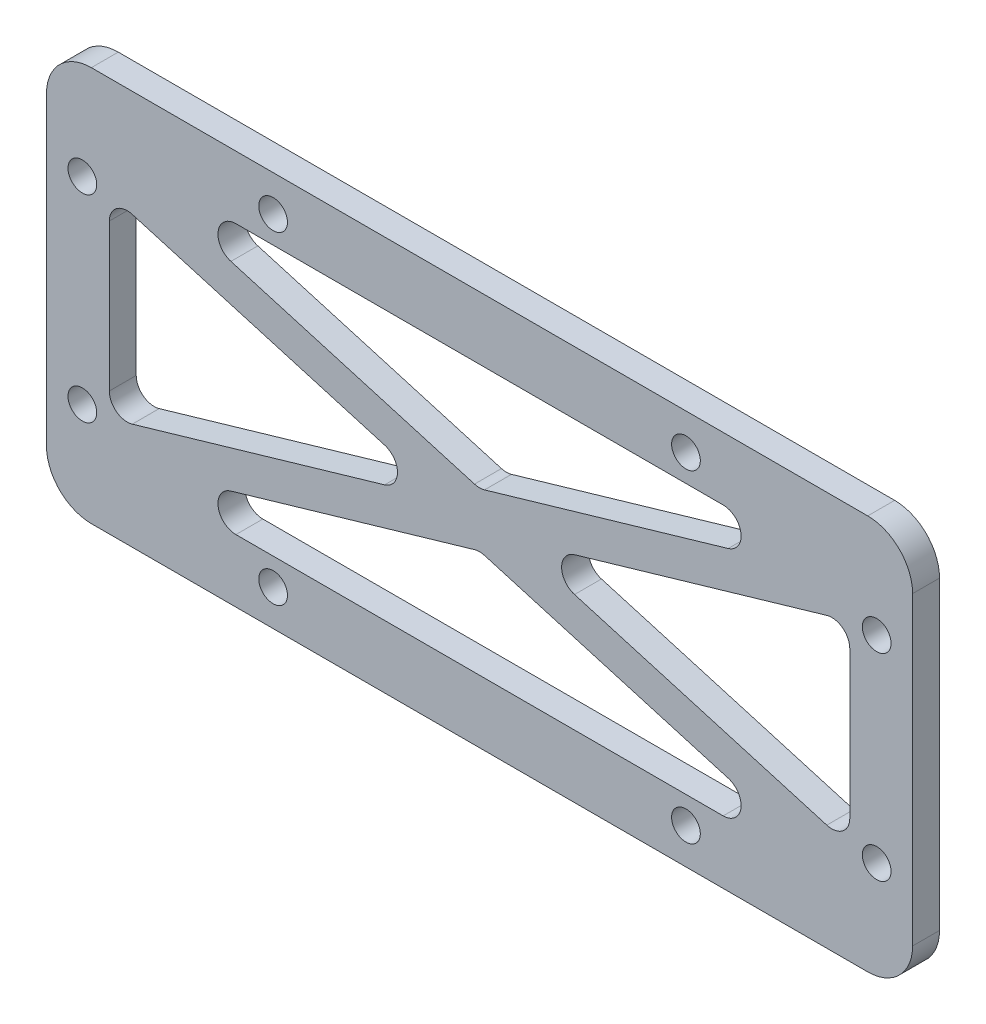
ISO-10303-21;
HEADER;
FILE_DESCRIPTION(('STEP AP214'),'2;1');
FILE_NAME('part.step','',(''),(''),'','','');
FILE_SCHEMA(('AUTOMOTIVE_DESIGN { 1 0 10303 214 1 1 1 1 }'));
ENDSEC;
DATA;
#1=APPLICATION_CONTEXT('core data for automotive mechanical design processes');
#2=APPLICATION_PROTOCOL_DEFINITION('international standard','automotive_design',2000,#1);
#3=PRODUCT_CONTEXT('',#1,'mechanical');
#4=PRODUCT('Part','Part','',(#3));
#5=PRODUCT_RELATED_PRODUCT_CATEGORY('part','',(#4));
#6=PRODUCT_DEFINITION_FORMATION('','',#4);
#7=PRODUCT_DEFINITION_CONTEXT('part definition',#1,'design');
#8=PRODUCT_DEFINITION('design','',#6,#7);
#9=PRODUCT_DEFINITION_SHAPE('','',#8);
#10=(LENGTH_UNIT() NAMED_UNIT(*) SI_UNIT(.MILLI.,.METRE.));
#11=(NAMED_UNIT(*) PLANE_ANGLE_UNIT() SI_UNIT($,.RADIAN.));
#12=(NAMED_UNIT(*) SI_UNIT($,.STERADIAN.) SOLID_ANGLE_UNIT());
#13=UNCERTAINTY_MEASURE_WITH_UNIT(LENGTH_MEASURE(1.E-05),#10,'distance_accuracy_value','');
#14=(GEOMETRIC_REPRESENTATION_CONTEXT(3) GLOBAL_UNCERTAINTY_ASSIGNED_CONTEXT((#13)) GLOBAL_UNIT_ASSIGNED_CONTEXT((#10,
#11,#12)) REPRESENTATION_CONTEXT('',''));
#15=CARTESIAN_POINT('',(0.,0.,0.));
#16=DIRECTION('',(0.,0.,1.));
#17=DIRECTION('',(1.,0.,0.));
#18=AXIS2_PLACEMENT_3D('',#15,#16,#17);
#19=CARTESIAN_POINT('',(-48.2507771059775,-22.,3.));
#20=DIRECTION('',(0.,1.,0.));
#21=DIRECTION('',(0.,0.,1.));
#22=AXIS2_PLACEMENT_3D('',#19,#20,#21);
#23=PLANE('',#22);
#24=DIRECTION('',(1.,0.,0.));
#25=VECTOR('',#24,1.);
#26=CARTESIAN_POINT('',(-48.2507771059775,-22.,3.));
#27=LINE('',#26,#25);
#28=CARTESIAN_POINT('',(-43.2507771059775,-22.,3.));
#29=VERTEX_POINT('',#28);
#30=CARTESIAN_POINT('',(43.2507771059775,-22.,3.));
#31=VERTEX_POINT('',#30);
#32=EDGE_CURVE('E267',#29,#31,#27,.T.);
#33=ORIENTED_EDGE('',*,*,#32,.F.);
#34=DIRECTION('',(0.,0.,-1.));
#35=VECTOR('',#34,1.);
#36=CARTESIAN_POINT('',(-43.2507771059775,-22.,0.));
#37=LINE('',#36,#35);
#38=CARTESIAN_POINT('',(-43.2507771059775,-22.,0.));
#39=VERTEX_POINT('',#38);
#40=EDGE_CURVE('E298',#29,#39,#37,.T.);
#41=ORIENTED_EDGE('',*,*,#40,.T.);
#42=DIRECTION('',(1.,0.,0.));
#43=VECTOR('',#42,1.);
#44=CARTESIAN_POINT('',(-48.2507771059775,-22.,0.));
#45=LINE('',#44,#43);
#46=CARTESIAN_POINT('',(43.2507771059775,-22.,0.));
#47=VERTEX_POINT('',#46);
#48=EDGE_CURVE('E251',#39,#47,#45,.T.);
#49=ORIENTED_EDGE('',*,*,#48,.T.);
#50=DIRECTION('',(0.,0.,-1.));
#51=VECTOR('',#50,1.);
#52=CARTESIAN_POINT('',(43.2507771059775,-22.,3.));
#53=LINE('',#52,#51);
#54=EDGE_CURVE('E296',#47,#31,#53,.F.);
#55=ORIENTED_EDGE('',*,*,#54,.T.);
#56=EDGE_LOOP('',(#33,#41,#49,#55));
#57=FACE_BOUND('',#56,.T.);
#58=ADVANCED_FACE('F36',(#57),#23,.F.);
#59=CARTESIAN_POINT('',(48.2507771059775,-22.,3.));
#60=DIRECTION('',(-1.,0.,0.));
#61=DIRECTION('',(0.,0.,1.));
#62=AXIS2_PLACEMENT_3D('',#59,#60,#61);
#63=PLANE('',#62);
#64=DIRECTION('',(0.,1.,0.));
#65=VECTOR('',#64,1.);
#66=CARTESIAN_POINT('',(48.2507771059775,-22.,3.));
#67=LINE('',#66,#65);
#68=CARTESIAN_POINT('',(48.2507771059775,-17.,3.));
#69=VERTEX_POINT('',#68);
#70=CARTESIAN_POINT('',(48.2507771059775,17.,3.));
#71=VERTEX_POINT('',#70);
#72=EDGE_CURVE('E508',#69,#71,#67,.T.);
#73=ORIENTED_EDGE('',*,*,#72,.F.);
#74=DIRECTION('',(0.,0.,-1.));
#75=VECTOR('',#74,1.);
#76=CARTESIAN_POINT('',(48.2507771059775,-17.,3.));
#77=LINE('',#76,#75);
#78=CARTESIAN_POINT('',(48.2507771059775,-17.,0.));
#79=VERTEX_POINT('',#78);
#80=EDGE_CURVE('E302',#69,#79,#77,.T.);
#81=ORIENTED_EDGE('',*,*,#80,.T.);
#82=DIRECTION('',(0.,1.,0.));
#83=VECTOR('',#82,1.);
#84=CARTESIAN_POINT('',(48.2507771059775,-22.,0.));
#85=LINE('',#84,#83);
#86=CARTESIAN_POINT('',(48.2507771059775,17.,0.));
#87=VERTEX_POINT('',#86);
#88=EDGE_CURVE('E514',#79,#87,#85,.T.);
#89=ORIENTED_EDGE('',*,*,#88,.T.);
#90=DIRECTION('',(0.,0.,-1.));
#91=VECTOR('',#90,1.);
#92=CARTESIAN_POINT('',(48.2507771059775,17.,3.));
#93=LINE('',#92,#91);
#94=EDGE_CURVE('E300',#87,#71,#93,.F.);
#95=ORIENTED_EDGE('',*,*,#94,.T.);
#96=EDGE_LOOP('',(#73,#81,#89,#95));
#97=FACE_BOUND('',#96,.T.);
#98=ADVANCED_FACE('F534',(#97),#63,.F.);
#99=CARTESIAN_POINT('',(-48.2507771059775,22.,3.));
#100=DIRECTION('',(0.,1.,0.));
#101=DIRECTION('',(0.,0.,1.));
#102=AXIS2_PLACEMENT_3D('',#99,#100,#101);
#103=PLANE('',#102);
#104=DIRECTION('',(1.,0.,0.));
#105=VECTOR('',#104,1.);
#106=CARTESIAN_POINT('',(-48.2507771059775,22.,0.));
#107=LINE('',#106,#105);
#108=CARTESIAN_POINT('',(-43.2507771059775,22.,0.));
#109=VERTEX_POINT('',#108);
#110=CARTESIAN_POINT('',(43.2507771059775,22.,0.));
#111=VERTEX_POINT('',#110);
#112=EDGE_CURVE('E268',#109,#111,#107,.T.);
#113=ORIENTED_EDGE('',*,*,#112,.F.);
#114=DIRECTION('',(0.,0.,-1.));
#115=VECTOR('',#114,1.);
#116=CARTESIAN_POINT('',(-43.2507771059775,22.,3.));
#117=LINE('',#116,#115);
#118=CARTESIAN_POINT('',(-43.2507771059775,22.,3.));
#119=VERTEX_POINT('',#118);
#120=EDGE_CURVE('E287',#109,#119,#117,.F.);
#121=ORIENTED_EDGE('',*,*,#120,.T.);
#122=DIRECTION('',(1.,0.,0.));
#123=VECTOR('',#122,1.);
#124=CARTESIAN_POINT('',(-48.2507771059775,22.,3.));
#125=LINE('',#124,#123);
#126=CARTESIAN_POINT('',(43.2507771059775,22.,3.));
#127=VERTEX_POINT('',#126);
#128=EDGE_CURVE('E277',#119,#127,#125,.T.);
#129=ORIENTED_EDGE('',*,*,#128,.T.);
#130=DIRECTION('',(0.,0.,-1.));
#131=VECTOR('',#130,1.);
#132=CARTESIAN_POINT('',(43.2507771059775,22.,0.));
#133=LINE('',#132,#131);
#134=EDGE_CURVE('E284',#127,#111,#133,.T.);
#135=ORIENTED_EDGE('',*,*,#134,.T.);
#136=EDGE_LOOP('',(#113,#121,#129,#135));
#137=FACE_BOUND('',#136,.T.);
#138=ADVANCED_FACE('F521',(#137),#103,.T.);
#139=CARTESIAN_POINT('',(-48.2507771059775,-22.,3.));
#140=DIRECTION('',(-1.,0.,0.));
#141=DIRECTION('',(0.,0.,1.));
#142=AXIS2_PLACEMENT_3D('',#139,#140,#141);
#143=PLANE('',#142);
#144=DIRECTION('',(0.,1.,0.));
#145=VECTOR('',#144,1.);
#146=CARTESIAN_POINT('',(-48.2507771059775,-22.,3.));
#147=LINE('',#146,#145);
#148=CARTESIAN_POINT('',(-48.2507771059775,-17.,3.));
#149=VERTEX_POINT('',#148);
#150=CARTESIAN_POINT('',(-48.2507771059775,17.,3.));
#151=VERTEX_POINT('',#150);
#152=EDGE_CURVE('E273',#149,#151,#147,.T.);
#153=ORIENTED_EDGE('',*,*,#152,.T.);
#154=DIRECTION('',(0.,0.,-1.));
#155=VECTOR('',#154,1.);
#156=CARTESIAN_POINT('',(-48.2507771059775,17.,3.));
#157=LINE('',#156,#155);
#158=CARTESIAN_POINT('',(-48.2507771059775,17.,0.));
#159=VERTEX_POINT('',#158);
#160=EDGE_CURVE('E266',#151,#159,#157,.T.);
#161=ORIENTED_EDGE('',*,*,#160,.T.);
#162=DIRECTION('',(0.,1.,0.));
#163=VECTOR('',#162,1.);
#164=CARTESIAN_POINT('',(-48.2507771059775,-22.,0.));
#165=LINE('',#164,#163);
#166=CARTESIAN_POINT('',(-48.2507771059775,-17.,0.));
#167=VERTEX_POINT('',#166);
#168=EDGE_CURVE('E249',#167,#159,#165,.T.);
#169=ORIENTED_EDGE('',*,*,#168,.F.);
#170=DIRECTION('',(0.,0.,-1.));
#171=VECTOR('',#170,1.);
#172=CARTESIAN_POINT('',(-48.2507771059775,-17.,3.));
#173=LINE('',#172,#171);
#174=EDGE_CURVE('E263',#167,#149,#173,.F.);
#175=ORIENTED_EDGE('',*,*,#174,.T.);
#176=EDGE_LOOP('',(#153,#161,#169,#175));
#177=FACE_BOUND('',#176,.T.);
#178=ADVANCED_FACE('F262',(#177),#143,.T.);
#179=CARTESIAN_POINT('',(0.,0.,3.));
#180=DIRECTION('',(0.,0.,1.));
#181=DIRECTION('',(1.,0.,0.));
#182=AXIS2_PLACEMENT_3D('',#179,#180,#181);
#183=PLANE('',#182);
#184=DIRECTION('',(-0.96,-0.28,0.));
#185=VECTOR('',#184,1.);
#186=CARTESIAN_POINT('',(-41.1428571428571,-15.,3.));
#187=LINE('',#186,#185);
#188=CARTESIAN_POINT('',(-0.559999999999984,-3.16333333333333,3.));
#189=VERTEX_POINT('',#188);
#190=CARTESIAN_POINT('',(-27.7028571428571,-11.08,3.));
#191=VERTEX_POINT('',#190);
#192=EDGE_CURVE('E1006',#189,#191,#187,.T.);
#193=ORIENTED_EDGE('',*,*,#192,.F.);
#194=CARTESIAN_POINT('',(0.,-5.08333333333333,3.));
#195=DIRECTION('',(0.,0.,1.));
#196=DIRECTION('',(1.,0.,0.));
#197=AXIS2_PLACEMENT_3D('',#194,#195,#196);
#198=CIRCLE('',#197,2.);
#199=CARTESIAN_POINT('',(0.560000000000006,-3.16333333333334,3.));
#200=VERTEX_POINT('',#199);
#201=EDGE_CURVE('E380',#189,#200,#198,.F.);
#202=ORIENTED_EDGE('',*,*,#201,.T.);
#203=DIRECTION('',(-0.96,0.28,0.));
#204=VECTOR('',#203,1.);
#205=CARTESIAN_POINT('',(0.,-3.,3.));
#206=LINE('',#205,#204);
#207=CARTESIAN_POINT('',(27.7028571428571,-11.08,3.));
#208=VERTEX_POINT('',#207);
#209=EDGE_CURVE('E1013',#208,#200,#206,.T.);
#210=ORIENTED_EDGE('',*,*,#209,.F.);
#211=CARTESIAN_POINT('',(27.1428571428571,-13.,3.));
#212=DIRECTION('',(0.,0.,1.));
#213=DIRECTION('',(1.,0.,0.));
#214=AXIS2_PLACEMENT_3D('',#211,#212,#213);
#215=CIRCLE('',#214,2.);
#216=CARTESIAN_POINT('',(27.1428571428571,-15.,3.));
#217=VERTEX_POINT('',#216);
#218=EDGE_CURVE('E372',#208,#217,#215,.F.);
#219=ORIENTED_EDGE('',*,*,#218,.T.);
#220=DIRECTION('',(1.,0.,0.));
#221=VECTOR('',#220,1.);
#222=CARTESIAN_POINT('',(41.1428571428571,-15.,3.));
#223=LINE('',#222,#221);
#224=CARTESIAN_POINT('',(-27.1428571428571,-15.,3.));
#225=VERTEX_POINT('',#224);
#226=EDGE_CURVE('E1007',#225,#217,#223,.T.);
#227=ORIENTED_EDGE('',*,*,#226,.F.);
#228=CARTESIAN_POINT('',(-27.1428571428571,-13.,3.));
#229=DIRECTION('',(0.,0.,1.));
#230=DIRECTION('',(1.,0.,0.));
#231=AXIS2_PLACEMENT_3D('',#228,#229,#230);
#232=CIRCLE('',#231,2.);
#233=EDGE_CURVE('E368',#225,#191,#232,.F.);
#234=ORIENTED_EDGE('',*,*,#233,.T.);
#235=EDGE_LOOP('',(#193,#202,#210,#219,#227,#234));
#236=FACE_BOUND('',#235,.T.);
#237=DIRECTION('',(0.,1.,0.));
#238=VECTOR('',#237,1.);
#239=CARTESIAN_POINT('',(41.2507771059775,10.8648099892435,3.));
#240=LINE('',#239,#238);
#241=CARTESIAN_POINT('',(41.2507771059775,-8.19814332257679,3.));
#242=VERTEX_POINT('',#241);
#243=CARTESIAN_POINT('',(41.2507771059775,8.1981433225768,3.));
#244=VERTEX_POINT('',#243);
#245=EDGE_CURVE('E1031',#242,#244,#240,.T.);
#246=ORIENTED_EDGE('',*,*,#245,.F.);
#247=CARTESIAN_POINT('',(39.2507771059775,-8.19814332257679,3.));
#248=DIRECTION('',(0.,0.,1.));
#249=DIRECTION('',(1.,0.,0.));
#250=AXIS2_PLACEMENT_3D('',#247,#248,#249);
#251=CIRCLE('',#250,2.);
#252=CARTESIAN_POINT('',(38.6907771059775,-10.1181433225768,3.));
#253=VERTEX_POINT('',#252);
#254=EDGE_CURVE('E388',#242,#253,#251,.F.);
#255=ORIENTED_EDGE('',*,*,#254,.T.);
#256=DIRECTION('',(0.96,-0.28,0.));
#257=VECTOR('',#256,1.);
#258=CARTESIAN_POINT('',(41.2507771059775,-10.8648099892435,3.));
#259=LINE('',#258,#257);
#260=CARTESIAN_POINT('',(10.5828571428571,-1.92,3.));
#261=VERTEX_POINT('',#260);
#262=EDGE_CURVE('E1024',#261,#253,#259,.T.);
#263=ORIENTED_EDGE('',*,*,#262,.F.);
#264=CARTESIAN_POINT('',(11.1428571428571,0.,3.));
#265=DIRECTION('',(0.,0.,1.));
#266=DIRECTION('',(1.,0.,0.));
#267=AXIS2_PLACEMENT_3D('',#264,#265,#266);
#268=CIRCLE('',#267,2.);
#269=CARTESIAN_POINT('',(10.5828571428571,1.92,3.));
#270=VERTEX_POINT('',#269);
#271=EDGE_CURVE('E384',#261,#270,#268,.F.);
#272=ORIENTED_EDGE('',*,*,#271,.T.);
#273=DIRECTION('',(-0.96,-0.28,0.));
#274=VECTOR('',#273,1.);
#275=CARTESIAN_POINT('',(4.,0.,3.));
#276=LINE('',#275,#274);
#277=CARTESIAN_POINT('',(38.6907771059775,10.1181433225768,3.));
#278=VERTEX_POINT('',#277);
#279=EDGE_CURVE('E1028',#278,#270,#276,.T.);
#280=ORIENTED_EDGE('',*,*,#279,.F.);
#281=CARTESIAN_POINT('',(39.2507771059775,8.1981433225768,3.));
#282=DIRECTION('',(0.,0.,1.));
#283=DIRECTION('',(1.,0.,0.));
#284=AXIS2_PLACEMENT_3D('',#281,#282,#283);
#285=CIRCLE('',#284,2.);
#286=EDGE_CURVE('E392',#278,#244,#285,.F.);
#287=ORIENTED_EDGE('',*,*,#286,.T.);
#288=EDGE_LOOP('',(#246,#255,#263,#272,#280,#287));
#289=FACE_BOUND('',#288,.T.);
#290=DIRECTION('',(-1.,0.,0.));
#291=VECTOR('',#290,1.);
#292=CARTESIAN_POINT('',(41.1428571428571,15.,3.));
#293=LINE('',#292,#291);
#294=CARTESIAN_POINT('',(27.1428571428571,15.,3.));
#295=VERTEX_POINT('',#294);
#296=CARTESIAN_POINT('',(-27.1428571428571,15.,3.));
#297=VERTEX_POINT('',#296);
#298=EDGE_CURVE('E411',#295,#297,#293,.T.);
#299=ORIENTED_EDGE('',*,*,#298,.F.);
#300=CARTESIAN_POINT('',(27.1428571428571,13.,3.));
#301=DIRECTION('',(0.,0.,1.));
#302=DIRECTION('',(1.,0.,0.));
#303=AXIS2_PLACEMENT_3D('',#300,#301,#302);
#304=CIRCLE('',#303,2.);
#305=CARTESIAN_POINT('',(27.7028571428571,11.08,3.));
#306=VERTEX_POINT('',#305);
#307=EDGE_CURVE('E400',#295,#306,#304,.F.);
#308=ORIENTED_EDGE('',*,*,#307,.T.);
#309=DIRECTION('',(0.96,0.28,0.));
#310=VECTOR('',#309,1.);
#311=CARTESIAN_POINT('',(0.,3.,3.));
#312=LINE('',#311,#310);
#313=CARTESIAN_POINT('',(0.559999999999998,3.16333333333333,3.));
#314=VERTEX_POINT('',#313);
#315=EDGE_CURVE('E434',#314,#306,#312,.T.);
#316=ORIENTED_EDGE('',*,*,#315,.F.);
#317=CARTESIAN_POINT('',(0.,5.08333333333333,3.));
#318=DIRECTION('',(0.,0.,1.));
#319=DIRECTION('',(1.,0.,0.));
#320=AXIS2_PLACEMENT_3D('',#317,#318,#319);
#321=CIRCLE('',#320,2.);
#322=CARTESIAN_POINT('',(-0.559999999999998,3.16333333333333,3.));
#323=VERTEX_POINT('',#322);
#324=EDGE_CURVE('E396',#314,#323,#321,.F.);
#325=ORIENTED_EDGE('',*,*,#324,.T.);
#326=DIRECTION('',(0.96,-0.28,0.));
#327=VECTOR('',#326,1.);
#328=CARTESIAN_POINT('',(-41.1428571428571,15.,3.));
#329=LINE('',#328,#327);
#330=CARTESIAN_POINT('',(-27.7028571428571,11.08,3.));
#331=VERTEX_POINT('',#330);
#332=EDGE_CURVE('E413',#331,#323,#329,.T.);
#333=ORIENTED_EDGE('',*,*,#332,.F.);
#334=CARTESIAN_POINT('',(-27.1428571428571,13.,3.));
#335=DIRECTION('',(0.,0.,1.));
#336=DIRECTION('',(1.,0.,0.));
#337=AXIS2_PLACEMENT_3D('',#334,#335,#336);
#338=CIRCLE('',#337,2.);
#339=EDGE_CURVE('E44',#331,#297,#338,.F.);
#340=ORIENTED_EDGE('',*,*,#339,.T.);
#341=EDGE_LOOP('',(#299,#308,#316,#325,#333,#340));
#342=FACE_BOUND('',#341,.T.);
#343=DIRECTION('',(-0.96,0.28,0.));
#344=VECTOR('',#343,1.);
#345=CARTESIAN_POINT('',(-4.,0.,3.));
#346=LINE('',#345,#344);
#347=CARTESIAN_POINT('',(-10.5828571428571,1.92,3.));
#348=VERTEX_POINT('',#347);
#349=CARTESIAN_POINT('',(-38.6907771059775,10.1181433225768,3.));
#350=VERTEX_POINT('',#349);
#351=EDGE_CURVE('E432',#348,#350,#346,.T.);
#352=ORIENTED_EDGE('',*,*,#351,.F.);
#353=CARTESIAN_POINT('',(-11.1428571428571,0.,3.));
#354=DIRECTION('',(0.,0.,1.));
#355=DIRECTION('',(1.,0.,0.));
#356=AXIS2_PLACEMENT_3D('',#353,#354,#355);
#357=CIRCLE('',#356,2.);
#358=CARTESIAN_POINT('',(-10.5828571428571,-1.92,3.));
#359=VERTEX_POINT('',#358);
#360=EDGE_CURVE('E376',#348,#359,#357,.F.);
#361=ORIENTED_EDGE('',*,*,#360,.T.);
#362=DIRECTION('',(0.96,0.28,0.));
#363=VECTOR('',#362,1.);
#364=CARTESIAN_POINT('',(-41.2507771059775,-10.8648099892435,3.));
#365=LINE('',#364,#363);
#366=CARTESIAN_POINT('',(-38.6907771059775,-10.1181433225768,3.));
#367=VERTEX_POINT('',#366);
#368=EDGE_CURVE('E445',#367,#359,#365,.T.);
#369=ORIENTED_EDGE('',*,*,#368,.F.);
#370=CARTESIAN_POINT('',(-39.2507771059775,-8.19814332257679,3.));
#371=DIRECTION('',(0.,0.,1.));
#372=DIRECTION('',(1.,0.,0.));
#373=AXIS2_PLACEMENT_3D('',#370,#371,#372);
#374=CIRCLE('',#373,2.);
#375=CARTESIAN_POINT('',(-41.2507771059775,-8.19814332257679,3.));
#376=VERTEX_POINT('',#375);
#377=EDGE_CURVE('E364',#367,#376,#374,.F.);
#378=ORIENTED_EDGE('',*,*,#377,.T.);
#379=DIRECTION('',(0.,-1.,0.));
#380=VECTOR('',#379,1.);
#381=CARTESIAN_POINT('',(-41.2507771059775,10.8648099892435,3.));
#382=LINE('',#381,#380);
#383=CARTESIAN_POINT('',(-41.2507771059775,8.1981433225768,3.));
#384=VERTEX_POINT('',#383);
#385=EDGE_CURVE('E454',#384,#376,#382,.T.);
#386=ORIENTED_EDGE('',*,*,#385,.F.);
#387=CARTESIAN_POINT('',(-39.2507771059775,8.1981433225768,3.));
#388=DIRECTION('',(0.,0.,1.));
#389=DIRECTION('',(1.,0.,0.));
#390=AXIS2_PLACEMENT_3D('',#387,#388,#389);
#391=CIRCLE('',#390,2.);
#392=EDGE_CURVE('E403',#384,#350,#391,.F.);
#393=ORIENTED_EDGE('',*,*,#392,.T.);
#394=EDGE_LOOP('',(#352,#361,#369,#378,#386,#393));
#395=FACE_BOUND('',#394,.T.);
#396=CARTESIAN_POINT('',(23.,18.,3.));
#397=DIRECTION('',(0.,0.,1.));
#398=DIRECTION('',(1.,0.,0.));
#399=AXIS2_PLACEMENT_3D('',#396,#397,#398);
#400=CIRCLE('',#399,1.6);
#401=CARTESIAN_POINT('',(24.6,18.,3.));
#402=VERTEX_POINT('',#401);
#403=EDGE_CURVE('E463',#402,#402,#400,.T.);
#404=ORIENTED_EDGE('',*,*,#403,.F.);
#405=EDGE_LOOP('',(#404));
#406=FACE_BOUND('',#405,.T.);
#407=CARTESIAN_POINT('',(23.,-18.,3.));
#408=DIRECTION('',(0.,0.,1.));
#409=DIRECTION('',(1.,0.,0.));
#410=AXIS2_PLACEMENT_3D('',#407,#408,#409);
#411=CIRCLE('',#410,1.6);
#412=CARTESIAN_POINT('',(24.6,-18.,3.));
#413=VERTEX_POINT('',#412);
#414=EDGE_CURVE('E469',#413,#413,#411,.T.);
#415=ORIENTED_EDGE('',*,*,#414,.F.);
#416=EDGE_LOOP('',(#415));
#417=FACE_BOUND('',#416,.T.);
#418=CARTESIAN_POINT('',(-23.,-18.,3.));
#419=DIRECTION('',(0.,0.,1.));
#420=DIRECTION('',(1.,0.,0.));
#421=AXIS2_PLACEMENT_3D('',#418,#419,#420);
#422=CIRCLE('',#421,1.6);
#423=CARTESIAN_POINT('',(-21.4,-18.,3.));
#424=VERTEX_POINT('',#423);
#425=EDGE_CURVE('E451',#424,#424,#422,.T.);
#426=ORIENTED_EDGE('',*,*,#425,.F.);
#427=EDGE_LOOP('',(#426));
#428=FACE_BOUND('',#427,.T.);
#429=CARTESIAN_POINT('',(-23.,18.,3.));
#430=DIRECTION('',(0.,0.,1.));
#431=DIRECTION('',(1.,0.,0.));
#432=AXIS2_PLACEMENT_3D('',#429,#430,#431);
#433=CIRCLE('',#432,1.6);
#434=CARTESIAN_POINT('',(-21.4,18.,3.));
#435=VERTEX_POINT('',#434);
#436=EDGE_CURVE('E462',#435,#435,#433,.T.);
#437=ORIENTED_EDGE('',*,*,#436,.F.);
#438=EDGE_LOOP('',(#437));
#439=FACE_BOUND('',#438,.T.);
#440=CARTESIAN_POINT('',(44.2507771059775,11.,3.));
#441=DIRECTION('',(0.,0.,1.));
#442=DIRECTION('',(1.,0.,0.));
#443=AXIS2_PLACEMENT_3D('',#440,#441,#442);
#444=CIRCLE('',#443,1.6);
#445=CARTESIAN_POINT('',(45.8507771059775,11.,3.));
#446=VERTEX_POINT('',#445);
#447=EDGE_CURVE('E487',#446,#446,#444,.T.);
#448=ORIENTED_EDGE('',*,*,#447,.F.);
#449=EDGE_LOOP('',(#448));
#450=FACE_BOUND('',#449,.T.);
#451=CARTESIAN_POINT('',(-44.2507771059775,-11.,3.));
#452=DIRECTION('',(0.,0.,1.));
#453=DIRECTION('',(1.,0.,0.));
#454=AXIS2_PLACEMENT_3D('',#451,#452,#453);
#455=CIRCLE('',#454,1.6);
#456=CARTESIAN_POINT('',(-42.6507771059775,-11.,3.));
#457=VERTEX_POINT('',#456);
#458=EDGE_CURVE('E493',#457,#457,#455,.T.);
#459=ORIENTED_EDGE('',*,*,#458,.F.);
#460=EDGE_LOOP('',(#459));
#461=FACE_BOUND('',#460,.T.);
#462=CARTESIAN_POINT('',(-44.2507771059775,11.,3.));
#463=DIRECTION('',(0.,0.,1.));
#464=DIRECTION('',(1.,0.,0.));
#465=AXIS2_PLACEMENT_3D('',#462,#463,#464);
#466=CIRCLE('',#465,1.6);
#467=CARTESIAN_POINT('',(-42.6507771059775,11.,3.));
#468=VERTEX_POINT('',#467);
#469=EDGE_CURVE('E480',#468,#468,#466,.T.);
#470=ORIENTED_EDGE('',*,*,#469,.F.);
#471=EDGE_LOOP('',(#470));
#472=FACE_BOUND('',#471,.T.);
#473=CARTESIAN_POINT('',(44.2507771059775,-11.,3.));
#474=DIRECTION('',(0.,0.,1.));
#475=DIRECTION('',(1.,0.,0.));
#476=AXIS2_PLACEMENT_3D('',#473,#474,#475);
#477=CIRCLE('',#476,1.6);
#478=CARTESIAN_POINT('',(45.8507771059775,-11.,3.));
#479=VERTEX_POINT('',#478);
#480=EDGE_CURVE('E486',#479,#479,#477,.T.);
#481=ORIENTED_EDGE('',*,*,#480,.F.);
#482=EDGE_LOOP('',(#481));
#483=FACE_BOUND('',#482,.T.);
#484=ORIENTED_EDGE('',*,*,#128,.F.);
#485=CARTESIAN_POINT('',(-43.2507771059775,17.,3.));
#486=DIRECTION('',(0.,0.,1.));
#487=DIRECTION('',(1.,0.,0.));
#488=AXIS2_PLACEMENT_3D('',#485,#486,#487);
#489=CIRCLE('',#488,5.);
#490=EDGE_CURVE('E294',#119,#151,#489,.T.);
#491=ORIENTED_EDGE('',*,*,#490,.T.);
#492=ORIENTED_EDGE('',*,*,#152,.F.);
#493=CARTESIAN_POINT('',(-43.2507771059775,-17.,3.));
#494=DIRECTION('',(0.,0.,1.));
#495=DIRECTION('',(1.,0.,0.));
#496=AXIS2_PLACEMENT_3D('',#493,#494,#495);
#497=CIRCLE('',#496,5.);
#498=EDGE_CURVE('E272',#149,#29,#497,.T.);
#499=ORIENTED_EDGE('',*,*,#498,.T.);
#500=ORIENTED_EDGE('',*,*,#32,.T.);
#501=CARTESIAN_POINT('',(43.2507771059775,-17.,3.));
#502=DIRECTION('',(0.,0.,1.));
#503=DIRECTION('',(1.,0.,0.));
#504=AXIS2_PLACEMENT_3D('',#501,#502,#503);
#505=CIRCLE('',#504,5.);
#506=EDGE_CURVE('E291',#31,#69,#505,.T.);
#507=ORIENTED_EDGE('',*,*,#506,.T.);
#508=ORIENTED_EDGE('',*,*,#72,.T.);
#509=CARTESIAN_POINT('',(43.2507771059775,17.,3.));
#510=DIRECTION('',(0.,0.,1.));
#511=DIRECTION('',(1.,0.,0.));
#512=AXIS2_PLACEMENT_3D('',#509,#510,#511);
#513=CIRCLE('',#512,5.);
#514=EDGE_CURVE('E289',#71,#127,#513,.T.);
#515=ORIENTED_EDGE('',*,*,#514,.T.);
#516=EDGE_LOOP('',(#484,#491,#492,#499,#500,#507,#508,#515));
#517=FACE_BOUND('',#516,.T.);
#518=ADVANCED_FACE('F409',(#236,#289,#342,#395,#406,#417,#428,#439,#450,#461,#472,#483,#517),
#183,.T.);
#519=CARTESIAN_POINT('',(0.,0.,0.));
#520=DIRECTION('',(0.,0.,1.));
#521=DIRECTION('',(1.,0.,0.));
#522=AXIS2_PLACEMENT_3D('',#519,#520,#521);
#523=PLANE('',#522);
#524=DIRECTION('',(1.,0.,0.));
#525=VECTOR('',#524,1.);
#526=CARTESIAN_POINT('',(41.1428571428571,-15.,0.));
#527=LINE('',#526,#525);
#528=CARTESIAN_POINT('',(-27.1428571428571,-15.,0.));
#529=VERTEX_POINT('',#528);
#530=CARTESIAN_POINT('',(27.1428571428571,-15.,0.));
#531=VERTEX_POINT('',#530);
#532=EDGE_CURVE('E993',#529,#531,#527,.T.);
#533=ORIENTED_EDGE('',*,*,#532,.T.);
#534=CARTESIAN_POINT('',(27.1428571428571,-13.,0.));
#535=DIRECTION('',(0.,0.,1.));
#536=DIRECTION('',(1.,0.,0.));
#537=AXIS2_PLACEMENT_3D('',#534,#535,#536);
#538=CIRCLE('',#537,2.);
#539=CARTESIAN_POINT('',(27.7028571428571,-11.08,0.));
#540=VERTEX_POINT('',#539);
#541=EDGE_CURVE('E374',#531,#540,#538,.T.);
#542=ORIENTED_EDGE('',*,*,#541,.T.);
#543=DIRECTION('',(-0.96,0.28,0.));
#544=VECTOR('',#543,1.);
#545=CARTESIAN_POINT('',(0.,-3.,0.));
#546=LINE('',#545,#544);
#547=CARTESIAN_POINT('',(0.560000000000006,-3.16333333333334,0.));
#548=VERTEX_POINT('',#547);
#549=EDGE_CURVE('E418',#540,#548,#546,.T.);
#550=ORIENTED_EDGE('',*,*,#549,.T.);
#551=CARTESIAN_POINT('',(0.,-5.08333333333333,0.));
#552=DIRECTION('',(0.,0.,1.));
#553=DIRECTION('',(1.,0.,0.));
#554=AXIS2_PLACEMENT_3D('',#551,#552,#553);
#555=CIRCLE('',#554,2.);
#556=CARTESIAN_POINT('',(-0.559999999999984,-3.16333333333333,0.));
#557=VERTEX_POINT('',#556);
#558=EDGE_CURVE('E382',#548,#557,#555,.T.);
#559=ORIENTED_EDGE('',*,*,#558,.T.);
#560=DIRECTION('',(-0.96,-0.28,0.));
#561=VECTOR('',#560,1.);
#562=CARTESIAN_POINT('',(-41.1428571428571,-15.,0.));
#563=LINE('',#562,#561);
#564=CARTESIAN_POINT('',(-27.7028571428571,-11.08,0.));
#565=VERTEX_POINT('',#564);
#566=EDGE_CURVE('E999',#557,#565,#563,.T.);
#567=ORIENTED_EDGE('',*,*,#566,.T.);
#568=CARTESIAN_POINT('',(-27.1428571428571,-13.,0.));
#569=DIRECTION('',(0.,0.,1.));
#570=DIRECTION('',(1.,0.,0.));
#571=AXIS2_PLACEMENT_3D('',#568,#569,#570);
#572=CIRCLE('',#571,2.);
#573=EDGE_CURVE('E370',#565,#529,#572,.T.);
#574=ORIENTED_EDGE('',*,*,#573,.T.);
#575=EDGE_LOOP('',(#533,#542,#550,#559,#567,#574));
#576=FACE_BOUND('',#575,.T.);
#577=DIRECTION('',(-0.96,-0.28,0.));
#578=VECTOR('',#577,1.);
#579=CARTESIAN_POINT('',(4.,0.,0.));
#580=LINE('',#579,#578);
#581=CARTESIAN_POINT('',(38.6907771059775,10.1181433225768,0.));
#582=VERTEX_POINT('',#581);
#583=CARTESIAN_POINT('',(10.5828571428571,1.92,0.));
#584=VERTEX_POINT('',#583);
#585=EDGE_CURVE('E1016',#582,#584,#580,.T.);
#586=ORIENTED_EDGE('',*,*,#585,.T.);
#587=CARTESIAN_POINT('',(11.1428571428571,0.,0.));
#588=DIRECTION('',(0.,0.,1.));
#589=DIRECTION('',(1.,0.,0.));
#590=AXIS2_PLACEMENT_3D('',#587,#588,#589);
#591=CIRCLE('',#590,2.);
#592=CARTESIAN_POINT('',(10.5828571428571,-1.92,0.));
#593=VERTEX_POINT('',#592);
#594=EDGE_CURVE('E386',#584,#593,#591,.T.);
#595=ORIENTED_EDGE('',*,*,#594,.T.);
#596=DIRECTION('',(0.96,-0.28,0.));
#597=VECTOR('',#596,1.);
#598=CARTESIAN_POINT('',(41.2507771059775,-10.8648099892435,0.));
#599=LINE('',#598,#597);
#600=CARTESIAN_POINT('',(38.6907771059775,-10.1181433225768,0.));
#601=VERTEX_POINT('',#600);
#602=EDGE_CURVE('E1011',#593,#601,#599,.T.);
#603=ORIENTED_EDGE('',*,*,#602,.T.);
#604=CARTESIAN_POINT('',(39.2507771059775,-8.19814332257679,0.));
#605=DIRECTION('',(0.,0.,1.));
#606=DIRECTION('',(1.,0.,0.));
#607=AXIS2_PLACEMENT_3D('',#604,#605,#606);
#608=CIRCLE('',#607,2.);
#609=CARTESIAN_POINT('',(41.2507771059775,-8.19814332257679,0.));
#610=VERTEX_POINT('',#609);
#611=EDGE_CURVE('E390',#601,#610,#608,.T.);
#612=ORIENTED_EDGE('',*,*,#611,.T.);
#613=DIRECTION('',(0.,1.,0.));
#614=VECTOR('',#613,1.);
#615=CARTESIAN_POINT('',(41.2507771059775,10.8648099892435,0.));
#616=LINE('',#615,#614);
#617=CARTESIAN_POINT('',(41.2507771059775,8.1981433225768,0.));
#618=VERTEX_POINT('',#617);
#619=EDGE_CURVE('E1027',#610,#618,#616,.T.);
#620=ORIENTED_EDGE('',*,*,#619,.T.);
#621=CARTESIAN_POINT('',(39.2507771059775,8.1981433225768,0.));
#622=DIRECTION('',(0.,0.,1.));
#623=DIRECTION('',(1.,0.,0.));
#624=AXIS2_PLACEMENT_3D('',#621,#622,#623);
#625=CIRCLE('',#624,2.);
#626=EDGE_CURVE('E394',#618,#582,#625,.T.);
#627=ORIENTED_EDGE('',*,*,#626,.T.);
#628=EDGE_LOOP('',(#586,#595,#603,#612,#620,#627));
#629=FACE_BOUND('',#628,.T.);
#630=DIRECTION('',(0.96,-0.28,0.));
#631=VECTOR('',#630,1.);
#632=CARTESIAN_POINT('',(-41.1428571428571,15.,0.));
#633=LINE('',#632,#631);
#634=CARTESIAN_POINT('',(-27.7028571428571,11.08,0.));
#635=VERTEX_POINT('',#634);
#636=CARTESIAN_POINT('',(-0.559999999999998,3.16333333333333,0.));
#637=VERTEX_POINT('',#636);
#638=EDGE_CURVE('E424',#635,#637,#633,.T.);
#639=ORIENTED_EDGE('',*,*,#638,.T.);
#640=CARTESIAN_POINT('',(0.,5.08333333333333,0.));
#641=DIRECTION('',(0.,0.,1.));
#642=DIRECTION('',(1.,0.,0.));
#643=AXIS2_PLACEMENT_3D('',#640,#641,#642);
#644=CIRCLE('',#643,2.);
#645=CARTESIAN_POINT('',(0.559999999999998,3.16333333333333,0.));
#646=VERTEX_POINT('',#645);
#647=EDGE_CURVE('E398',#637,#646,#644,.T.);
#648=ORIENTED_EDGE('',*,*,#647,.T.);
#649=DIRECTION('',(0.96,0.28,0.));
#650=VECTOR('',#649,1.);
#651=CARTESIAN_POINT('',(0.,3.,0.));
#652=LINE('',#651,#650);
#653=CARTESIAN_POINT('',(27.7028571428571,11.08,0.));
#654=VERTEX_POINT('',#653);
#655=EDGE_CURVE('E430',#646,#654,#652,.T.);
#656=ORIENTED_EDGE('',*,*,#655,.T.);
#657=CARTESIAN_POINT('',(27.1428571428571,13.,0.));
#658=DIRECTION('',(0.,0.,1.));
#659=DIRECTION('',(1.,0.,0.));
#660=AXIS2_PLACEMENT_3D('',#657,#658,#659);
#661=CIRCLE('',#660,2.);
#662=CARTESIAN_POINT('',(27.1428571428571,15.,0.));
#663=VERTEX_POINT('',#662);
#664=EDGE_CURVE('E58',#654,#663,#661,.T.);
#665=ORIENTED_EDGE('',*,*,#664,.T.);
#666=DIRECTION('',(-1.,0.,0.));
#667=VECTOR('',#666,1.);
#668=CARTESIAN_POINT('',(41.1428571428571,15.,0.));
#669=LINE('',#668,#667);
#670=CARTESIAN_POINT('',(-27.1428571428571,15.,0.));
#671=VERTEX_POINT('',#670);
#672=EDGE_CURVE('E426',#663,#671,#669,.T.);
#673=ORIENTED_EDGE('',*,*,#672,.T.);
#674=CARTESIAN_POINT('',(-27.1428571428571,13.,0.));
#675=DIRECTION('',(0.,0.,1.));
#676=DIRECTION('',(1.,0.,0.));
#677=AXIS2_PLACEMENT_3D('',#674,#675,#676);
#678=CIRCLE('',#677,2.);
#679=EDGE_CURVE('E11',#671,#635,#678,.T.);
#680=ORIENTED_EDGE('',*,*,#679,.T.);
#681=EDGE_LOOP('',(#639,#648,#656,#665,#673,#680));
#682=FACE_BOUND('',#681,.T.);
#683=DIRECTION('',(0.,-1.,0.));
#684=VECTOR('',#683,1.);
#685=CARTESIAN_POINT('',(-41.2507771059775,10.8648099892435,0.));
#686=LINE('',#685,#684);
#687=CARTESIAN_POINT('',(-41.2507771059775,8.1981433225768,0.));
#688=VERTEX_POINT('',#687);
#689=CARTESIAN_POINT('',(-41.2507771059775,-8.19814332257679,0.));
#690=VERTEX_POINT('',#689);
#691=EDGE_CURVE('E444',#688,#690,#686,.T.);
#692=ORIENTED_EDGE('',*,*,#691,.T.);
#693=CARTESIAN_POINT('',(-39.2507771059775,-8.19814332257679,0.));
#694=DIRECTION('',(0.,0.,1.));
#695=DIRECTION('',(1.,0.,0.));
#696=AXIS2_PLACEMENT_3D('',#693,#694,#695);
#697=CIRCLE('',#696,2.);
#698=CARTESIAN_POINT('',(-38.6907771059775,-10.1181433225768,0.));
#699=VERTEX_POINT('',#698);
#700=EDGE_CURVE('E366',#690,#699,#697,.T.);
#701=ORIENTED_EDGE('',*,*,#700,.T.);
#702=DIRECTION('',(0.96,0.28,0.));
#703=VECTOR('',#702,1.);
#704=CARTESIAN_POINT('',(-41.2507771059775,-10.8648099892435,0.));
#705=LINE('',#704,#703);
#706=CARTESIAN_POINT('',(-10.5828571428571,-1.92,0.));
#707=VERTEX_POINT('',#706);
#708=EDGE_CURVE('E448',#699,#707,#705,.T.);
#709=ORIENTED_EDGE('',*,*,#708,.T.);
#710=CARTESIAN_POINT('',(-11.1428571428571,0.,0.));
#711=DIRECTION('',(0.,0.,1.));
#712=DIRECTION('',(1.,0.,0.));
#713=AXIS2_PLACEMENT_3D('',#710,#711,#712);
#714=CIRCLE('',#713,2.);
#715=CARTESIAN_POINT('',(-10.5828571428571,1.92,0.));
#716=VERTEX_POINT('',#715);
#717=EDGE_CURVE('E378',#707,#716,#714,.T.);
#718=ORIENTED_EDGE('',*,*,#717,.T.);
#719=DIRECTION('',(-0.96,0.28,0.));
#720=VECTOR('',#719,1.);
#721=CARTESIAN_POINT('',(-4.,0.,0.));
#722=LINE('',#721,#720);
#723=CARTESIAN_POINT('',(-38.6907771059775,10.1181433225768,0.));
#724=VERTEX_POINT('',#723);
#725=EDGE_CURVE('E441',#716,#724,#722,.T.);
#726=ORIENTED_EDGE('',*,*,#725,.T.);
#727=CARTESIAN_POINT('',(-39.2507771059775,8.1981433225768,0.));
#728=DIRECTION('',(0.,0.,1.));
#729=DIRECTION('',(1.,0.,0.));
#730=AXIS2_PLACEMENT_3D('',#727,#728,#729);
#731=CIRCLE('',#730,2.);
#732=EDGE_CURVE('E405',#724,#688,#731,.T.);
#733=ORIENTED_EDGE('',*,*,#732,.T.);
#734=EDGE_LOOP('',(#692,#701,#709,#718,#726,#733));
#735=FACE_BOUND('',#734,.T.);
#736=CARTESIAN_POINT('',(23.,18.,0.));
#737=DIRECTION('',(0.,0.,1.));
#738=DIRECTION('',(1.,0.,0.));
#739=AXIS2_PLACEMENT_3D('',#736,#737,#738);
#740=CIRCLE('',#739,1.6);
#741=CARTESIAN_POINT('',(24.6,18.,0.));
#742=VERTEX_POINT('',#741);
#743=EDGE_CURVE('E459',#742,#742,#740,.T.);
#744=ORIENTED_EDGE('',*,*,#743,.T.);
#745=EDGE_LOOP('',(#744));
#746=FACE_BOUND('',#745,.T.);
#747=CARTESIAN_POINT('',(23.,-18.,0.));
#748=DIRECTION('',(0.,0.,1.));
#749=DIRECTION('',(1.,0.,0.));
#750=AXIS2_PLACEMENT_3D('',#747,#748,#749);
#751=CIRCLE('',#750,1.6);
#752=CARTESIAN_POINT('',(24.6,-18.,0.));
#753=VERTEX_POINT('',#752);
#754=EDGE_CURVE('E466',#753,#753,#751,.T.);
#755=ORIENTED_EDGE('',*,*,#754,.T.);
#756=EDGE_LOOP('',(#755));
#757=FACE_BOUND('',#756,.T.);
#758=CARTESIAN_POINT('',(-23.,-18.,0.));
#759=DIRECTION('',(0.,0.,1.));
#760=DIRECTION('',(1.,0.,0.));
#761=AXIS2_PLACEMENT_3D('',#758,#759,#760);
#762=CIRCLE('',#761,1.6);
#763=CARTESIAN_POINT('',(-21.4,-18.,0.));
#764=VERTEX_POINT('',#763);
#765=EDGE_CURVE('E472',#764,#764,#762,.T.);
#766=ORIENTED_EDGE('',*,*,#765,.T.);
#767=EDGE_LOOP('',(#766));
#768=FACE_BOUND('',#767,.T.);
#769=CARTESIAN_POINT('',(-23.,18.,0.));
#770=DIRECTION('',(0.,0.,1.));
#771=DIRECTION('',(1.,0.,0.));
#772=AXIS2_PLACEMENT_3D('',#769,#770,#771);
#773=CIRCLE('',#772,1.6);
#774=CARTESIAN_POINT('',(-21.4,18.,0.));
#775=VERTEX_POINT('',#774);
#776=EDGE_CURVE('E477',#775,#775,#773,.T.);
#777=ORIENTED_EDGE('',*,*,#776,.T.);
#778=EDGE_LOOP('',(#777));
#779=FACE_BOUND('',#778,.T.);
#780=CARTESIAN_POINT('',(44.2507771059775,11.,0.));
#781=DIRECTION('',(0.,0.,1.));
#782=DIRECTION('',(1.,0.,0.));
#783=AXIS2_PLACEMENT_3D('',#780,#781,#782);
#784=CIRCLE('',#783,1.6);
#785=CARTESIAN_POINT('',(45.8507771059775,11.,0.));
#786=VERTEX_POINT('',#785);
#787=EDGE_CURVE('E483',#786,#786,#784,.T.);
#788=ORIENTED_EDGE('',*,*,#787,.T.);
#789=EDGE_LOOP('',(#788));
#790=FACE_BOUND('',#789,.T.);
#791=CARTESIAN_POINT('',(-44.2507771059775,-11.,0.));
#792=DIRECTION('',(0.,0.,1.));
#793=DIRECTION('',(1.,0.,0.));
#794=AXIS2_PLACEMENT_3D('',#791,#792,#793);
#795=CIRCLE('',#794,1.6);
#796=CARTESIAN_POINT('',(-42.6507771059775,-11.,0.));
#797=VERTEX_POINT('',#796);
#798=EDGE_CURVE('E490',#797,#797,#795,.T.);
#799=ORIENTED_EDGE('',*,*,#798,.T.);
#800=EDGE_LOOP('',(#799));
#801=FACE_BOUND('',#800,.T.);
#802=CARTESIAN_POINT('',(-44.2507771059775,11.,0.));
#803=DIRECTION('',(0.,0.,1.));
#804=DIRECTION('',(1.,0.,0.));
#805=AXIS2_PLACEMENT_3D('',#802,#803,#804);
#806=CIRCLE('',#805,1.6);
#807=CARTESIAN_POINT('',(-42.6507771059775,11.,0.));
#808=VERTEX_POINT('',#807);
#809=EDGE_CURVE('E496',#808,#808,#806,.T.);
#810=ORIENTED_EDGE('',*,*,#809,.T.);
#811=EDGE_LOOP('',(#810));
#812=FACE_BOUND('',#811,.T.);
#813=CARTESIAN_POINT('',(44.2507771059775,-11.,0.));
#814=DIRECTION('',(0.,0.,1.));
#815=DIRECTION('',(1.,0.,0.));
#816=AXIS2_PLACEMENT_3D('',#813,#814,#815);
#817=CIRCLE('',#816,1.6);
#818=CARTESIAN_POINT('',(45.8507771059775,-11.,0.));
#819=VERTEX_POINT('',#818);
#820=EDGE_CURVE('E501',#819,#819,#817,.T.);
#821=ORIENTED_EDGE('',*,*,#820,.T.);
#822=EDGE_LOOP('',(#821));
#823=FACE_BOUND('',#822,.T.);
#824=ORIENTED_EDGE('',*,*,#168,.T.);
#825=CARTESIAN_POINT('',(-43.2507771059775,17.,0.));
#826=DIRECTION('',(0.,0.,1.));
#827=DIRECTION('',(1.,0.,0.));
#828=AXIS2_PLACEMENT_3D('',#825,#826,#827);
#829=CIRCLE('',#828,5.);
#830=EDGE_CURVE('E256',#159,#109,#829,.F.);
#831=ORIENTED_EDGE('',*,*,#830,.T.);
#832=ORIENTED_EDGE('',*,*,#112,.T.);
#833=CARTESIAN_POINT('',(43.2507771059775,17.,0.));
#834=DIRECTION('',(0.,0.,1.));
#835=DIRECTION('',(1.,0.,0.));
#836=AXIS2_PLACEMENT_3D('',#833,#834,#835);
#837=CIRCLE('',#836,5.);
#838=EDGE_CURVE('E275',#111,#87,#837,.F.);
#839=ORIENTED_EDGE('',*,*,#838,.T.);
#840=ORIENTED_EDGE('',*,*,#88,.F.);
#841=CARTESIAN_POINT('',(43.2507771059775,-17.,0.));
#842=DIRECTION('',(0.,0.,1.));
#843=DIRECTION('',(1.,0.,0.));
#844=AXIS2_PLACEMENT_3D('',#841,#842,#843);
#845=CIRCLE('',#844,5.);
#846=EDGE_CURVE('E257',#79,#47,#845,.F.);
#847=ORIENTED_EDGE('',*,*,#846,.T.);
#848=ORIENTED_EDGE('',*,*,#48,.F.);
#849=CARTESIAN_POINT('',(-43.2507771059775,-17.,0.));
#850=DIRECTION('',(0.,0.,1.));
#851=DIRECTION('',(1.,0.,0.));
#852=AXIS2_PLACEMENT_3D('',#849,#850,#851);
#853=CIRCLE('',#852,5.);
#854=EDGE_CURVE('E246',#39,#167,#853,.F.);
#855=ORIENTED_EDGE('',*,*,#854,.T.);
#856=EDGE_LOOP('',(#824,#831,#832,#839,#840,#847,#848,#855));
#857=FACE_BOUND('',#856,.T.);
#858=ADVANCED_FACE('F248',(#576,#629,#682,#735,#746,#757,#768,#779,#790,#801,#812,#823,#857),
#523,.F.);
#859=CARTESIAN_POINT('',(44.2507771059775,-11.,0.));
#860=DIRECTION('',(0.,0.,1.));
#861=DIRECTION('',(1.,0.,0.));
#862=AXIS2_PLACEMENT_3D('',#859,#860,#861);
#863=CYLINDRICAL_SURFACE('',#862,1.6);
#864=ORIENTED_EDGE('',*,*,#820,.F.);
#865=EDGE_LOOP('',(#864));
#866=FACE_BOUND('',#865,.T.);
#867=ORIENTED_EDGE('',*,*,#480,.T.);
#868=EDGE_LOOP('',(#867));
#869=FACE_BOUND('',#868,.T.);
#870=ADVANCED_FACE('F647',(#866,#869),#863,.F.);
#871=CARTESIAN_POINT('',(-44.2507771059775,11.,0.));
#872=DIRECTION('',(0.,0.,1.));
#873=DIRECTION('',(1.,0.,0.));
#874=AXIS2_PLACEMENT_3D('',#871,#872,#873);
#875=CYLINDRICAL_SURFACE('',#874,1.6);
#876=ORIENTED_EDGE('',*,*,#809,.F.);
#877=EDGE_LOOP('',(#876));
#878=FACE_BOUND('',#877,.T.);
#879=ORIENTED_EDGE('',*,*,#469,.T.);
#880=EDGE_LOOP('',(#879));
#881=FACE_BOUND('',#880,.T.);
#882=ADVANCED_FACE('F649',(#878,#881),#875,.F.);
#883=CARTESIAN_POINT('',(-44.2507771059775,-11.,0.));
#884=DIRECTION('',(0.,0.,1.));
#885=DIRECTION('',(1.,0.,0.));
#886=AXIS2_PLACEMENT_3D('',#883,#884,#885);
#887=CYLINDRICAL_SURFACE('',#886,1.6);
#888=ORIENTED_EDGE('',*,*,#798,.F.);
#889=EDGE_LOOP('',(#888));
#890=FACE_BOUND('',#889,.T.);
#891=ORIENTED_EDGE('',*,*,#458,.T.);
#892=EDGE_LOOP('',(#891));
#893=FACE_BOUND('',#892,.T.);
#894=ADVANCED_FACE('F656',(#890,#893),#887,.F.);
#895=CARTESIAN_POINT('',(44.2507771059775,11.,0.));
#896=DIRECTION('',(0.,0.,1.));
#897=DIRECTION('',(1.,0.,0.));
#898=AXIS2_PLACEMENT_3D('',#895,#896,#897);
#899=CYLINDRICAL_SURFACE('',#898,1.6);
#900=ORIENTED_EDGE('',*,*,#787,.F.);
#901=EDGE_LOOP('',(#900));
#902=FACE_BOUND('',#901,.T.);
#903=ORIENTED_EDGE('',*,*,#447,.T.);
#904=EDGE_LOOP('',(#903));
#905=FACE_BOUND('',#904,.T.);
#906=ADVANCED_FACE('F887',(#902,#905),#899,.F.);
#907=CARTESIAN_POINT('',(-23.,18.,0.));
#908=DIRECTION('',(0.,0.,1.));
#909=DIRECTION('',(1.,0.,0.));
#910=AXIS2_PLACEMENT_3D('',#907,#908,#909);
#911=CYLINDRICAL_SURFACE('',#910,1.6);
#912=ORIENTED_EDGE('',*,*,#776,.F.);
#913=EDGE_LOOP('',(#912));
#914=FACE_BOUND('',#913,.T.);
#915=ORIENTED_EDGE('',*,*,#436,.T.);
#916=EDGE_LOOP('',(#915));
#917=FACE_BOUND('',#916,.T.);
#918=ADVANCED_FACE('F883',(#914,#917),#911,.F.);
#919=CARTESIAN_POINT('',(-23.,-18.,0.));
#920=DIRECTION('',(0.,0.,1.));
#921=DIRECTION('',(1.,0.,0.));
#922=AXIS2_PLACEMENT_3D('',#919,#920,#921);
#923=CYLINDRICAL_SURFACE('',#922,1.6);
#924=ORIENTED_EDGE('',*,*,#765,.F.);
#925=EDGE_LOOP('',(#924));
#926=FACE_BOUND('',#925,.T.);
#927=ORIENTED_EDGE('',*,*,#425,.T.);
#928=EDGE_LOOP('',(#927));
#929=FACE_BOUND('',#928,.T.);
#930=ADVANCED_FACE('F879',(#926,#929),#923,.F.);
#931=CARTESIAN_POINT('',(23.,-18.,0.));
#932=DIRECTION('',(0.,0.,1.));
#933=DIRECTION('',(1.,0.,0.));
#934=AXIS2_PLACEMENT_3D('',#931,#932,#933);
#935=CYLINDRICAL_SURFACE('',#934,1.6);
#936=ORIENTED_EDGE('',*,*,#754,.F.);
#937=EDGE_LOOP('',(#936));
#938=FACE_BOUND('',#937,.T.);
#939=ORIENTED_EDGE('',*,*,#414,.T.);
#940=EDGE_LOOP('',(#939));
#941=FACE_BOUND('',#940,.T.);
#942=ADVANCED_FACE('F875',(#938,#941),#935,.F.);
#943=CARTESIAN_POINT('',(23.,18.,0.));
#944=DIRECTION('',(0.,0.,1.));
#945=DIRECTION('',(1.,0.,0.));
#946=AXIS2_PLACEMENT_3D('',#943,#944,#945);
#947=CYLINDRICAL_SURFACE('',#946,1.6);
#948=ORIENTED_EDGE('',*,*,#743,.F.);
#949=EDGE_LOOP('',(#948));
#950=FACE_BOUND('',#949,.T.);
#951=ORIENTED_EDGE('',*,*,#403,.T.);
#952=EDGE_LOOP('',(#951));
#953=FACE_BOUND('',#952,.T.);
#954=ADVANCED_FACE('F552',(#950,#953),#947,.F.);
#955=CARTESIAN_POINT('',(-43.2507771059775,17.,3.));
#956=DIRECTION('',(0.,0.,-1.));
#957=DIRECTION('',(-1.,0.,0.));
#958=AXIS2_PLACEMENT_3D('',#955,#956,#957);
#959=CYLINDRICAL_SURFACE('',#958,5.);
#960=ORIENTED_EDGE('',*,*,#490,.F.);
#961=ORIENTED_EDGE('',*,*,#120,.F.);
#962=ORIENTED_EDGE('',*,*,#830,.F.);
#963=ORIENTED_EDGE('',*,*,#160,.F.);
#964=EDGE_LOOP('',(#960,#961,#962,#963));
#965=FACE_BOUND('',#964,.T.);
#966=ADVANCED_FACE('F526',(#965),#959,.T.);
#967=CARTESIAN_POINT('',(-43.2507771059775,-17.,3.));
#968=DIRECTION('',(0.,0.,1.));
#969=DIRECTION('',(1.,0.,0.));
#970=AXIS2_PLACEMENT_3D('',#967,#968,#969);
#971=CYLINDRICAL_SURFACE('',#970,5.);
#972=ORIENTED_EDGE('',*,*,#498,.F.);
#973=ORIENTED_EDGE('',*,*,#174,.F.);
#974=ORIENTED_EDGE('',*,*,#854,.F.);
#975=ORIENTED_EDGE('',*,*,#40,.F.);
#976=EDGE_LOOP('',(#972,#973,#974,#975));
#977=FACE_BOUND('',#976,.T.);
#978=ADVANCED_FACE('F271',(#977),#971,.T.);
#979=CARTESIAN_POINT('',(43.2507771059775,-17.,3.));
#980=DIRECTION('',(0.,0.,-1.));
#981=DIRECTION('',(-1.,0.,0.));
#982=AXIS2_PLACEMENT_3D('',#979,#980,#981);
#983=CYLINDRICAL_SURFACE('',#982,5.);
#984=ORIENTED_EDGE('',*,*,#506,.F.);
#985=ORIENTED_EDGE('',*,*,#54,.F.);
#986=ORIENTED_EDGE('',*,*,#846,.F.);
#987=ORIENTED_EDGE('',*,*,#80,.F.);
#988=EDGE_LOOP('',(#984,#985,#986,#987));
#989=FACE_BOUND('',#988,.T.);
#990=ADVANCED_FACE('F540',(#989),#983,.T.);
#991=CARTESIAN_POINT('',(43.2507771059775,17.,3.));
#992=DIRECTION('',(0.,0.,1.));
#993=DIRECTION('',(1.,0.,0.));
#994=AXIS2_PLACEMENT_3D('',#991,#992,#993);
#995=CYLINDRICAL_SURFACE('',#994,5.);
#996=ORIENTED_EDGE('',*,*,#514,.F.);
#997=ORIENTED_EDGE('',*,*,#94,.F.);
#998=ORIENTED_EDGE('',*,*,#838,.F.);
#999=ORIENTED_EDGE('',*,*,#134,.F.);
#1000=EDGE_LOOP('',(#996,#997,#998,#999));
#1001=FACE_BOUND('',#1000,.T.);
#1002=ADVANCED_FACE('F530',(#1001),#995,.T.);
#1003=CARTESIAN_POINT('',(-4.,0.,0.));
#1004=DIRECTION('',(0.28,0.96,0.));
#1005=DIRECTION('',(-0.96,0.28,0.));
#1006=AXIS2_PLACEMENT_3D('',#1003,#1004,#1005);
#1007=PLANE('',#1006);
#1008=ORIENTED_EDGE('',*,*,#725,.F.);
#1009=DIRECTION('',(0.,0.,1.));
#1010=VECTOR('',#1009,1.);
#1011=CARTESIAN_POINT('',(-10.5828571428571,1.92,3.));
#1012=LINE('',#1011,#1010);
#1013=EDGE_CURVE('E332',#716,#348,#1012,.T.);
#1014=ORIENTED_EDGE('',*,*,#1013,.T.);
#1015=ORIENTED_EDGE('',*,*,#351,.T.);
#1016=DIRECTION('',(0.,0.,1.));
#1017=VECTOR('',#1016,1.);
#1018=CARTESIAN_POINT('',(-38.6907771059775,10.1181433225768,0.));
#1019=LINE('',#1018,#1017);
#1020=EDGE_CURVE('E330',#350,#724,#1019,.F.);
#1021=ORIENTED_EDGE('',*,*,#1020,.T.);
#1022=EDGE_LOOP('',(#1008,#1014,#1015,#1021));
#1023=FACE_BOUND('',#1022,.T.);
#1024=ADVANCED_FACE('F559',(#1023),#1007,.F.);
#1025=CARTESIAN_POINT('',(-41.2507771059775,-10.8648099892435,0.));
#1026=DIRECTION('',(0.28,-0.96,0.));
#1027=DIRECTION('',(0.96,0.28,0.));
#1028=AXIS2_PLACEMENT_3D('',#1025,#1026,#1027);
#1029=PLANE('',#1028);
#1030=ORIENTED_EDGE('',*,*,#708,.F.);
#1031=DIRECTION('',(0.,0.,1.));
#1032=VECTOR('',#1031,1.);
#1033=CARTESIAN_POINT('',(-38.6907771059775,-10.1181433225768,3.));
#1034=LINE('',#1033,#1032);
#1035=EDGE_CURVE('E307',#699,#367,#1034,.T.);
#1036=ORIENTED_EDGE('',*,*,#1035,.T.);
#1037=ORIENTED_EDGE('',*,*,#368,.T.);
#1038=DIRECTION('',(0.,0.,1.));
#1039=VECTOR('',#1038,1.);
#1040=CARTESIAN_POINT('',(-10.5828571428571,-1.92,0.));
#1041=LINE('',#1040,#1039);
#1042=EDGE_CURVE('E305',#359,#707,#1041,.F.);
#1043=ORIENTED_EDGE('',*,*,#1042,.T.);
#1044=EDGE_LOOP('',(#1030,#1036,#1037,#1043));
#1045=FACE_BOUND('',#1044,.T.);
#1046=ADVANCED_FACE('F621',(#1045),#1029,.F.);
#1047=CARTESIAN_POINT('',(-41.2507771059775,10.8648099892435,0.));
#1048=DIRECTION('',(-1.,0.,0.));
#1049=DIRECTION('',(0.,0.,1.));
#1050=AXIS2_PLACEMENT_3D('',#1047,#1048,#1049);
#1051=PLANE('',#1050);
#1052=ORIENTED_EDGE('',*,*,#385,.T.);
#1053=DIRECTION('',(0.,0.,1.));
#1054=VECTOR('',#1053,1.);
#1055=CARTESIAN_POINT('',(-41.2507771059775,-8.19814332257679,0.));
#1056=LINE('',#1055,#1054);
#1057=EDGE_CURVE('E313',#376,#690,#1056,.F.);
#1058=ORIENTED_EDGE('',*,*,#1057,.T.);
#1059=ORIENTED_EDGE('',*,*,#691,.F.);
#1060=DIRECTION('',(0.,0.,1.));
#1061=VECTOR('',#1060,1.);
#1062=CARTESIAN_POINT('',(-41.2507771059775,8.1981433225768,3.));
#1063=LINE('',#1062,#1061);
#1064=EDGE_CURVE('E310',#688,#384,#1063,.T.);
#1065=ORIENTED_EDGE('',*,*,#1064,.T.);
#1066=EDGE_LOOP('',(#1052,#1058,#1059,#1065));
#1067=FACE_BOUND('',#1066,.T.);
#1068=ADVANCED_FACE('F614',(#1067),#1051,.F.);
#1069=CARTESIAN_POINT('',(41.1428571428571,15.,0.));
#1070=DIRECTION('',(0.,1.,0.));
#1071=DIRECTION('',(0.,0.,1.));
#1072=AXIS2_PLACEMENT_3D('',#1069,#1070,#1071);
#1073=PLANE('',#1072);
#1074=ORIENTED_EDGE('',*,*,#672,.F.);
#1075=DIRECTION('',(0.,0.,1.));
#1076=VECTOR('',#1075,1.);
#1077=CARTESIAN_POINT('',(27.1428571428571,15.,3.));
#1078=LINE('',#1077,#1076);
#1079=EDGE_CURVE('E361',#663,#295,#1078,.T.);
#1080=ORIENTED_EDGE('',*,*,#1079,.T.);
#1081=ORIENTED_EDGE('',*,*,#298,.T.);
#1082=DIRECTION('',(0.,0.,1.));
#1083=VECTOR('',#1082,1.);
#1084=CARTESIAN_POINT('',(-27.1428571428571,15.,0.));
#1085=LINE('',#1084,#1083);
#1086=EDGE_CURVE('E51',#297,#671,#1085,.F.);
#1087=ORIENTED_EDGE('',*,*,#1086,.T.);
#1088=EDGE_LOOP('',(#1074,#1080,#1081,#1087));
#1089=FACE_BOUND('',#1088,.T.);
#1090=ADVANCED_FACE('F416',(#1089),#1073,.F.);
#1091=CARTESIAN_POINT('',(0.,3.,0.));
#1092=DIRECTION('',(0.28,-0.96,0.));
#1093=DIRECTION('',(0.96,0.28,0.));
#1094=AXIS2_PLACEMENT_3D('',#1091,#1092,#1093);
#1095=PLANE('',#1094);
#1096=ORIENTED_EDGE('',*,*,#655,.F.);
#1097=DIRECTION('',(0.,0.,1.));
#1098=VECTOR('',#1097,1.);
#1099=CARTESIAN_POINT('',(0.559999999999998,3.16333333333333,3.));
#1100=LINE('',#1099,#1098);
#1101=EDGE_CURVE('E352',#646,#314,#1100,.T.);
#1102=ORIENTED_EDGE('',*,*,#1101,.T.);
#1103=ORIENTED_EDGE('',*,*,#315,.T.);
#1104=DIRECTION('',(0.,0.,1.));
#1105=VECTOR('',#1104,1.);
#1106=CARTESIAN_POINT('',(27.7028571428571,11.08,0.));
#1107=LINE('',#1106,#1105);
#1108=EDGE_CURVE('E350',#306,#654,#1107,.F.);
#1109=ORIENTED_EDGE('',*,*,#1108,.T.);
#1110=EDGE_LOOP('',(#1096,#1102,#1103,#1109));
#1111=FACE_BOUND('',#1110,.T.);
#1112=ADVANCED_FACE('F721',(#1111),#1095,.F.);
#1113=CARTESIAN_POINT('',(-41.1428571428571,15.,0.));
#1114=DIRECTION('',(-0.28,-0.96,0.));
#1115=DIRECTION('',(0.96,-0.28,0.));
#1116=AXIS2_PLACEMENT_3D('',#1113,#1114,#1115);
#1117=PLANE('',#1116);
#1118=ORIENTED_EDGE('',*,*,#332,.T.);
#1119=DIRECTION('',(0.,0.,1.));
#1120=VECTOR('',#1119,1.);
#1121=CARTESIAN_POINT('',(-0.560000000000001,3.16333333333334,0.));
#1122=LINE('',#1121,#1120);
#1123=EDGE_CURVE('E358',#323,#637,#1122,.F.);
#1124=ORIENTED_EDGE('',*,*,#1123,.T.);
#1125=ORIENTED_EDGE('',*,*,#638,.F.);
#1126=DIRECTION('',(0.,0.,1.));
#1127=VECTOR('',#1126,1.);
#1128=CARTESIAN_POINT('',(-27.7028571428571,11.08,3.));
#1129=LINE('',#1128,#1127);
#1130=EDGE_CURVE('E355',#635,#331,#1129,.T.);
#1131=ORIENTED_EDGE('',*,*,#1130,.T.);
#1132=EDGE_LOOP('',(#1118,#1124,#1125,#1131));
#1133=FACE_BOUND('',#1132,.T.);
#1134=ADVANCED_FACE('F428',(#1133),#1117,.F.);
#1135=CARTESIAN_POINT('',(41.2507771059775,10.8648099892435,0.));
#1136=DIRECTION('',(1.,0.,0.));
#1137=DIRECTION('',(0.,0.,-1.));
#1138=AXIS2_PLACEMENT_3D('',#1135,#1136,#1137);
#1139=PLANE('',#1138);
#1140=ORIENTED_EDGE('',*,*,#619,.F.);
#1141=DIRECTION('',(0.,0.,1.));
#1142=VECTOR('',#1141,1.);
#1143=CARTESIAN_POINT('',(41.2507771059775,-8.19814332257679,3.));
#1144=LINE('',#1143,#1142);
#1145=EDGE_CURVE('E347',#610,#242,#1144,.T.);
#1146=ORIENTED_EDGE('',*,*,#1145,.T.);
#1147=ORIENTED_EDGE('',*,*,#245,.T.);
#1148=DIRECTION('',(0.,0.,1.));
#1149=VECTOR('',#1148,1.);
#1150=CARTESIAN_POINT('',(41.2507771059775,8.1981433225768,0.));
#1151=LINE('',#1150,#1149);
#1152=EDGE_CURVE('E345',#244,#618,#1151,.F.);
#1153=ORIENTED_EDGE('',*,*,#1152,.T.);
#1154=EDGE_LOOP('',(#1140,#1146,#1147,#1153));
#1155=FACE_BOUND('',#1154,.T.);
#1156=ADVANCED_FACE('F739',(#1155),#1139,.F.);
#1157=CARTESIAN_POINT('',(41.2507771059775,-10.8648099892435,0.));
#1158=DIRECTION('',(-0.28,-0.96,0.));
#1159=DIRECTION('',(0.96,-0.28,0.));
#1160=AXIS2_PLACEMENT_3D('',#1157,#1158,#1159);
#1161=PLANE('',#1160);
#1162=ORIENTED_EDGE('',*,*,#602,.F.);
#1163=DIRECTION('',(0.,0.,1.));
#1164=VECTOR('',#1163,1.);
#1165=CARTESIAN_POINT('',(10.5828571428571,-1.92,3.));
#1166=LINE('',#1165,#1164);
#1167=EDGE_CURVE('E337',#593,#261,#1166,.T.);
#1168=ORIENTED_EDGE('',*,*,#1167,.T.);
#1169=ORIENTED_EDGE('',*,*,#262,.T.);
#1170=DIRECTION('',(0.,0.,1.));
#1171=VECTOR('',#1170,1.);
#1172=CARTESIAN_POINT('',(38.6907771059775,-10.1181433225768,0.));
#1173=LINE('',#1172,#1171);
#1174=EDGE_CURVE('E335',#253,#601,#1173,.F.);
#1175=ORIENTED_EDGE('',*,*,#1174,.T.);
#1176=EDGE_LOOP('',(#1162,#1168,#1169,#1175));
#1177=FACE_BOUND('',#1176,.T.);
#1178=ADVANCED_FACE('F748',(#1177),#1161,.F.);
#1179=CARTESIAN_POINT('',(4.,0.,0.));
#1180=DIRECTION('',(-0.28,0.96,0.));
#1181=DIRECTION('',(-0.96,-0.28,0.));
#1182=AXIS2_PLACEMENT_3D('',#1179,#1180,#1181);
#1183=PLANE('',#1182);
#1184=ORIENTED_EDGE('',*,*,#279,.T.);
#1185=DIRECTION('',(0.,0.,1.));
#1186=VECTOR('',#1185,1.);
#1187=CARTESIAN_POINT('',(10.5828571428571,1.92,0.));
#1188=LINE('',#1187,#1186);
#1189=EDGE_CURVE('E343',#270,#584,#1188,.F.);
#1190=ORIENTED_EDGE('',*,*,#1189,.T.);
#1191=ORIENTED_EDGE('',*,*,#585,.F.);
#1192=DIRECTION('',(0.,0.,1.));
#1193=VECTOR('',#1192,1.);
#1194=CARTESIAN_POINT('',(38.6907771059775,10.1181433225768,3.));
#1195=LINE('',#1194,#1193);
#1196=EDGE_CURVE('E340',#582,#278,#1195,.T.);
#1197=ORIENTED_EDGE('',*,*,#1196,.T.);
#1198=EDGE_LOOP('',(#1184,#1190,#1191,#1197));
#1199=FACE_BOUND('',#1198,.T.);
#1200=ADVANCED_FACE('F758',(#1199),#1183,.F.);
#1201=CARTESIAN_POINT('',(-41.1428571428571,-15.,0.));
#1202=DIRECTION('',(-0.28,0.96,0.));
#1203=DIRECTION('',(-0.96,-0.28,0.));
#1204=AXIS2_PLACEMENT_3D('',#1201,#1202,#1203);
#1205=PLANE('',#1204);
#1206=ORIENTED_EDGE('',*,*,#192,.T.);
#1207=DIRECTION('',(0.,0.,1.));
#1208=VECTOR('',#1207,1.);
#1209=CARTESIAN_POINT('',(-27.7028571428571,-11.08,0.));
#1210=LINE('',#1209,#1208);
#1211=EDGE_CURVE('E323',#191,#565,#1210,.F.);
#1212=ORIENTED_EDGE('',*,*,#1211,.T.);
#1213=ORIENTED_EDGE('',*,*,#566,.F.);
#1214=DIRECTION('',(0.,0.,1.));
#1215=VECTOR('',#1214,1.);
#1216=CARTESIAN_POINT('',(-0.559999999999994,-3.16333333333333,3.));
#1217=LINE('',#1216,#1215);
#1218=EDGE_CURVE('E320',#557,#189,#1217,.T.);
#1219=ORIENTED_EDGE('',*,*,#1218,.T.);
#1220=EDGE_LOOP('',(#1206,#1212,#1213,#1219));
#1221=FACE_BOUND('',#1220,.T.);
#1222=ADVANCED_FACE('F768',(#1221),#1205,.F.);
#1223=CARTESIAN_POINT('',(0.,-3.,0.));
#1224=DIRECTION('',(0.28,0.96,0.));
#1225=DIRECTION('',(-0.96,0.28,0.));
#1226=AXIS2_PLACEMENT_3D('',#1223,#1224,#1225);
#1227=PLANE('',#1226);
#1228=ORIENTED_EDGE('',*,*,#549,.F.);
#1229=DIRECTION('',(0.,0.,1.));
#1230=VECTOR('',#1229,1.);
#1231=CARTESIAN_POINT('',(27.7028571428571,-11.08,3.));
#1232=LINE('',#1231,#1230);
#1233=EDGE_CURVE('E327',#540,#208,#1232,.T.);
#1234=ORIENTED_EDGE('',*,*,#1233,.T.);
#1235=ORIENTED_EDGE('',*,*,#209,.T.);
#1236=DIRECTION('',(0.,0.,1.));
#1237=VECTOR('',#1236,1.);
#1238=CARTESIAN_POINT('',(0.560000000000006,-3.16333333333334,0.));
#1239=LINE('',#1238,#1237);
#1240=EDGE_CURVE('E325',#200,#548,#1239,.F.);
#1241=ORIENTED_EDGE('',*,*,#1240,.T.);
#1242=EDGE_LOOP('',(#1228,#1234,#1235,#1241));
#1243=FACE_BOUND('',#1242,.T.);
#1244=ADVANCED_FACE('F778',(#1243),#1227,.F.);
#1245=CARTESIAN_POINT('',(41.1428571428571,-15.,0.));
#1246=DIRECTION('',(0.,-1.,0.));
#1247=DIRECTION('',(0.,0.,-1.));
#1248=AXIS2_PLACEMENT_3D('',#1245,#1246,#1247);
#1249=PLANE('',#1248);
#1250=ORIENTED_EDGE('',*,*,#532,.F.);
#1251=DIRECTION('',(0.,0.,1.));
#1252=VECTOR('',#1251,1.);
#1253=CARTESIAN_POINT('',(-27.1428571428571,-15.,3.));
#1254=LINE('',#1253,#1252);
#1255=EDGE_CURVE('E317',#529,#225,#1254,.T.);
#1256=ORIENTED_EDGE('',*,*,#1255,.T.);
#1257=ORIENTED_EDGE('',*,*,#226,.T.);
#1258=DIRECTION('',(0.,0.,1.));
#1259=VECTOR('',#1258,1.);
#1260=CARTESIAN_POINT('',(27.1428571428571,-15.,0.));
#1261=LINE('',#1260,#1259);
#1262=EDGE_CURVE('E315',#217,#531,#1261,.F.);
#1263=ORIENTED_EDGE('',*,*,#1262,.T.);
#1264=EDGE_LOOP('',(#1250,#1256,#1257,#1263));
#1265=FACE_BOUND('',#1264,.T.);
#1266=ADVANCED_FACE('F564',(#1265),#1249,.F.);
#1267=CARTESIAN_POINT('',(-39.2507771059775,-8.19814332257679,0.));
#1268=DIRECTION('',(0.,0.,-1.));
#1269=DIRECTION('',(-1.,0.,0.));
#1270=AXIS2_PLACEMENT_3D('',#1267,#1268,#1269);
#1271=CYLINDRICAL_SURFACE('',#1270,2.);
#1272=ORIENTED_EDGE('',*,*,#700,.F.);
#1273=ORIENTED_EDGE('',*,*,#1057,.F.);
#1274=ORIENTED_EDGE('',*,*,#377,.F.);
#1275=ORIENTED_EDGE('',*,*,#1035,.F.);
#1276=EDGE_LOOP('',(#1272,#1273,#1274,#1275));
#1277=FACE_BOUND('',#1276,.T.);
#1278=ADVANCED_FACE('F560',(#1277),#1271,.F.);
#1279=CARTESIAN_POINT('',(-27.1428571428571,-13.,0.));
#1280=DIRECTION('',(0.,0.,-1.));
#1281=DIRECTION('',(-1.,0.,0.));
#1282=AXIS2_PLACEMENT_3D('',#1279,#1280,#1281);
#1283=CYLINDRICAL_SURFACE('',#1282,2.);
#1284=ORIENTED_EDGE('',*,*,#573,.F.);
#1285=ORIENTED_EDGE('',*,*,#1211,.F.);
#1286=ORIENTED_EDGE('',*,*,#233,.F.);
#1287=ORIENTED_EDGE('',*,*,#1255,.F.);
#1288=EDGE_LOOP('',(#1284,#1285,#1286,#1287));
#1289=FACE_BOUND('',#1288,.T.);
#1290=ADVANCED_FACE('F563',(#1289),#1283,.F.);
#1291=CARTESIAN_POINT('',(27.1428571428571,-13.,0.));
#1292=DIRECTION('',(0.,0.,-1.));
#1293=DIRECTION('',(-1.,0.,0.));
#1294=AXIS2_PLACEMENT_3D('',#1291,#1292,#1293);
#1295=CYLINDRICAL_SURFACE('',#1294,2.);
#1296=ORIENTED_EDGE('',*,*,#541,.F.);
#1297=ORIENTED_EDGE('',*,*,#1262,.F.);
#1298=ORIENTED_EDGE('',*,*,#218,.F.);
#1299=ORIENTED_EDGE('',*,*,#1233,.F.);
#1300=EDGE_LOOP('',(#1296,#1297,#1298,#1299));
#1301=FACE_BOUND('',#1300,.T.);
#1302=ADVANCED_FACE('F568',(#1301),#1295,.F.);
#1303=CARTESIAN_POINT('',(-11.1428571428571,0.,0.));
#1304=DIRECTION('',(0.,0.,-1.));
#1305=DIRECTION('',(-1.,0.,0.));
#1306=AXIS2_PLACEMENT_3D('',#1303,#1304,#1305);
#1307=CYLINDRICAL_SURFACE('',#1306,2.);
#1308=ORIENTED_EDGE('',*,*,#717,.F.);
#1309=ORIENTED_EDGE('',*,*,#1042,.F.);
#1310=ORIENTED_EDGE('',*,*,#360,.F.);
#1311=ORIENTED_EDGE('',*,*,#1013,.F.);
#1312=EDGE_LOOP('',(#1308,#1309,#1310,#1311));
#1313=FACE_BOUND('',#1312,.T.);
#1314=ADVANCED_FACE('F572',(#1313),#1307,.F.);
#1315=CARTESIAN_POINT('',(0.,-5.08333333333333,0.));
#1316=DIRECTION('',(0.,0.,-1.));
#1317=DIRECTION('',(-1.,0.,0.));
#1318=AXIS2_PLACEMENT_3D('',#1315,#1316,#1317);
#1319=CYLINDRICAL_SURFACE('',#1318,2.);
#1320=ORIENTED_EDGE('',*,*,#558,.F.);
#1321=ORIENTED_EDGE('',*,*,#1240,.F.);
#1322=ORIENTED_EDGE('',*,*,#201,.F.);
#1323=ORIENTED_EDGE('',*,*,#1218,.F.);
#1324=EDGE_LOOP('',(#1320,#1321,#1322,#1323));
#1325=FACE_BOUND('',#1324,.T.);
#1326=ADVANCED_FACE('F576',(#1325),#1319,.F.);
#1327=CARTESIAN_POINT('',(11.1428571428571,0.,0.));
#1328=DIRECTION('',(0.,0.,-1.));
#1329=DIRECTION('',(-1.,0.,0.));
#1330=AXIS2_PLACEMENT_3D('',#1327,#1328,#1329);
#1331=CYLINDRICAL_SURFACE('',#1330,2.);
#1332=ORIENTED_EDGE('',*,*,#594,.F.);
#1333=ORIENTED_EDGE('',*,*,#1189,.F.);
#1334=ORIENTED_EDGE('',*,*,#271,.F.);
#1335=ORIENTED_EDGE('',*,*,#1167,.F.);
#1336=EDGE_LOOP('',(#1332,#1333,#1334,#1335));
#1337=FACE_BOUND('',#1336,.T.);
#1338=ADVANCED_FACE('F580',(#1337),#1331,.F.);
#1339=CARTESIAN_POINT('',(39.2507771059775,-8.19814332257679,0.));
#1340=DIRECTION('',(0.,0.,-1.));
#1341=DIRECTION('',(-1.,0.,0.));
#1342=AXIS2_PLACEMENT_3D('',#1339,#1340,#1341);
#1343=CYLINDRICAL_SURFACE('',#1342,2.);
#1344=ORIENTED_EDGE('',*,*,#611,.F.);
#1345=ORIENTED_EDGE('',*,*,#1174,.F.);
#1346=ORIENTED_EDGE('',*,*,#254,.F.);
#1347=ORIENTED_EDGE('',*,*,#1145,.F.);
#1348=EDGE_LOOP('',(#1344,#1345,#1346,#1347));
#1349=FACE_BOUND('',#1348,.T.);
#1350=ADVANCED_FACE('F584',(#1349),#1343,.F.);
#1351=CARTESIAN_POINT('',(39.2507771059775,8.1981433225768,0.));
#1352=DIRECTION('',(0.,0.,-1.));
#1353=DIRECTION('',(-1.,0.,0.));
#1354=AXIS2_PLACEMENT_3D('',#1351,#1352,#1353);
#1355=CYLINDRICAL_SURFACE('',#1354,2.);
#1356=ORIENTED_EDGE('',*,*,#626,.F.);
#1357=ORIENTED_EDGE('',*,*,#1152,.F.);
#1358=ORIENTED_EDGE('',*,*,#286,.F.);
#1359=ORIENTED_EDGE('',*,*,#1196,.F.);
#1360=EDGE_LOOP('',(#1356,#1357,#1358,#1359));
#1361=FACE_BOUND('',#1360,.T.);
#1362=ADVANCED_FACE('F588',(#1361),#1355,.F.);
#1363=CARTESIAN_POINT('',(0.,5.08333333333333,0.));
#1364=DIRECTION('',(0.,0.,-1.));
#1365=DIRECTION('',(-1.,0.,0.));
#1366=AXIS2_PLACEMENT_3D('',#1363,#1364,#1365);
#1367=CYLINDRICAL_SURFACE('',#1366,2.);
#1368=ORIENTED_EDGE('',*,*,#647,.F.);
#1369=ORIENTED_EDGE('',*,*,#1123,.F.);
#1370=ORIENTED_EDGE('',*,*,#324,.F.);
#1371=ORIENTED_EDGE('',*,*,#1101,.F.);
#1372=EDGE_LOOP('',(#1368,#1369,#1370,#1371));
#1373=FACE_BOUND('',#1372,.T.);
#1374=ADVANCED_FACE('F592',(#1373),#1367,.F.);
#1375=CARTESIAN_POINT('',(27.1428571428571,13.,0.));
#1376=DIRECTION('',(0.,0.,-1.));
#1377=DIRECTION('',(-1.,0.,0.));
#1378=AXIS2_PLACEMENT_3D('',#1375,#1376,#1377);
#1379=CYLINDRICAL_SURFACE('',#1378,2.);
#1380=ORIENTED_EDGE('',*,*,#664,.F.);
#1381=ORIENTED_EDGE('',*,*,#1108,.F.);
#1382=ORIENTED_EDGE('',*,*,#307,.F.);
#1383=ORIENTED_EDGE('',*,*,#1079,.F.);
#1384=EDGE_LOOP('',(#1380,#1381,#1382,#1383));
#1385=FACE_BOUND('',#1384,.T.);
#1386=ADVANCED_FACE('F596',(#1385),#1379,.F.);
#1387=CARTESIAN_POINT('',(-39.2507771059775,8.1981433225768,0.));
#1388=DIRECTION('',(0.,0.,-1.));
#1389=DIRECTION('',(-1.,0.,0.));
#1390=AXIS2_PLACEMENT_3D('',#1387,#1388,#1389);
#1391=CYLINDRICAL_SURFACE('',#1390,2.);
#1392=ORIENTED_EDGE('',*,*,#732,.F.);
#1393=ORIENTED_EDGE('',*,*,#1020,.F.);
#1394=ORIENTED_EDGE('',*,*,#392,.F.);
#1395=ORIENTED_EDGE('',*,*,#1064,.F.);
#1396=EDGE_LOOP('',(#1392,#1393,#1394,#1395));
#1397=FACE_BOUND('',#1396,.T.);
#1398=ADVANCED_FACE('F599',(#1397),#1391,.F.);
#1399=CARTESIAN_POINT('',(-27.1428571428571,13.,0.));
#1400=DIRECTION('',(0.,0.,-1.));
#1401=DIRECTION('',(-1.,0.,0.));
#1402=AXIS2_PLACEMENT_3D('',#1399,#1400,#1401);
#1403=CYLINDRICAL_SURFACE('',#1402,2.);
#1404=ORIENTED_EDGE('',*,*,#679,.F.);
#1405=ORIENTED_EDGE('',*,*,#1086,.F.);
#1406=ORIENTED_EDGE('',*,*,#339,.F.);
#1407=ORIENTED_EDGE('',*,*,#1130,.F.);
#1408=EDGE_LOOP('',(#1404,#1405,#1406,#1407));
#1409=FACE_BOUND('',#1408,.T.);
#1410=ADVANCED_FACE('F38',(#1409),#1403,.F.);
#1411=CLOSED_SHELL('',(#58,#98,#138,#178,#518,#858,#870,#882,#894,#906,#918,#930,#942,#954,#966,
#978,#990,#1002,#1024,#1046,#1068,#1090,#1112,#1134,#1156,#1178,#1200,#1222,#1244,#1266,#1278,
#1290,#1302,#1314,#1326,#1338,#1350,#1362,#1374,#1386,#1398,#1410));
#1412=MANIFOLD_SOLID_BREP('B2',#1411);
#1413=ADVANCED_BREP_SHAPE_REPRESENTATION('',(#18,#1412),#14);
#1414=SHAPE_DEFINITION_REPRESENTATION(#9,#1413);
ENDSEC;
END-ISO-10303-21;
